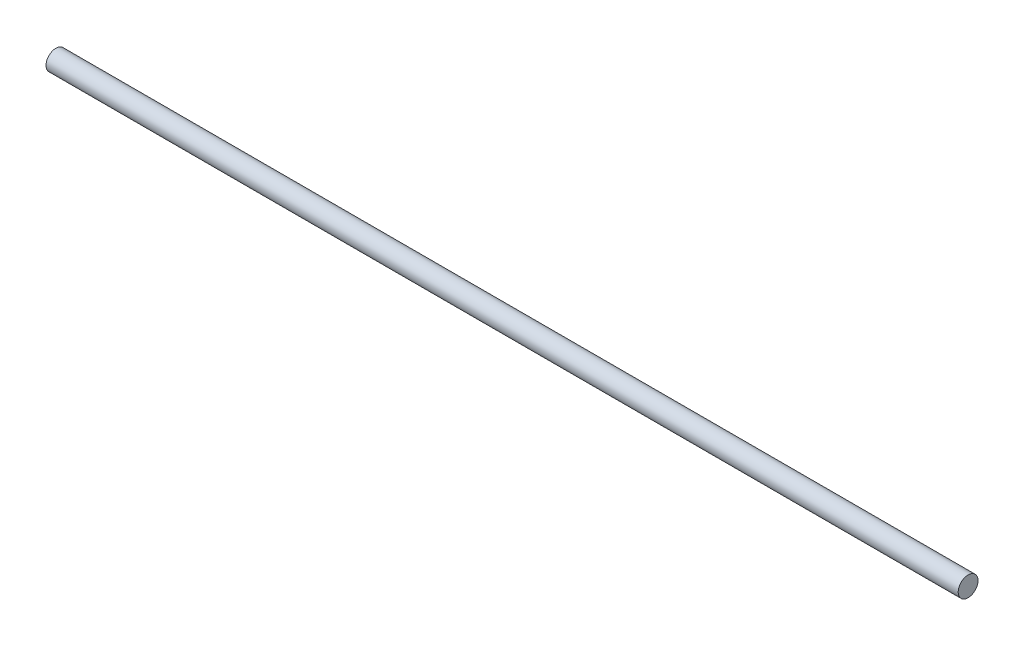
from build123d import *

# Parameters (mm, degrees)
SKETCH1_R               = 28.6639
N18_2_257IN_8_7FT_DEPTH = 1318.225


with BuildPart() as part:
    # Sketch1 → N18 - 2.257in - 8.7ft (new, symmetric)
    with BuildSketch(Plane.YZ):
        with Locations(Location((0, 0, 0), (0, 0, 90))):
            Circle(SKETCH1_R)
    extrude(amount=N18_2_257IN_8_7FT_DEPTH, both=True)


solid = part.part
